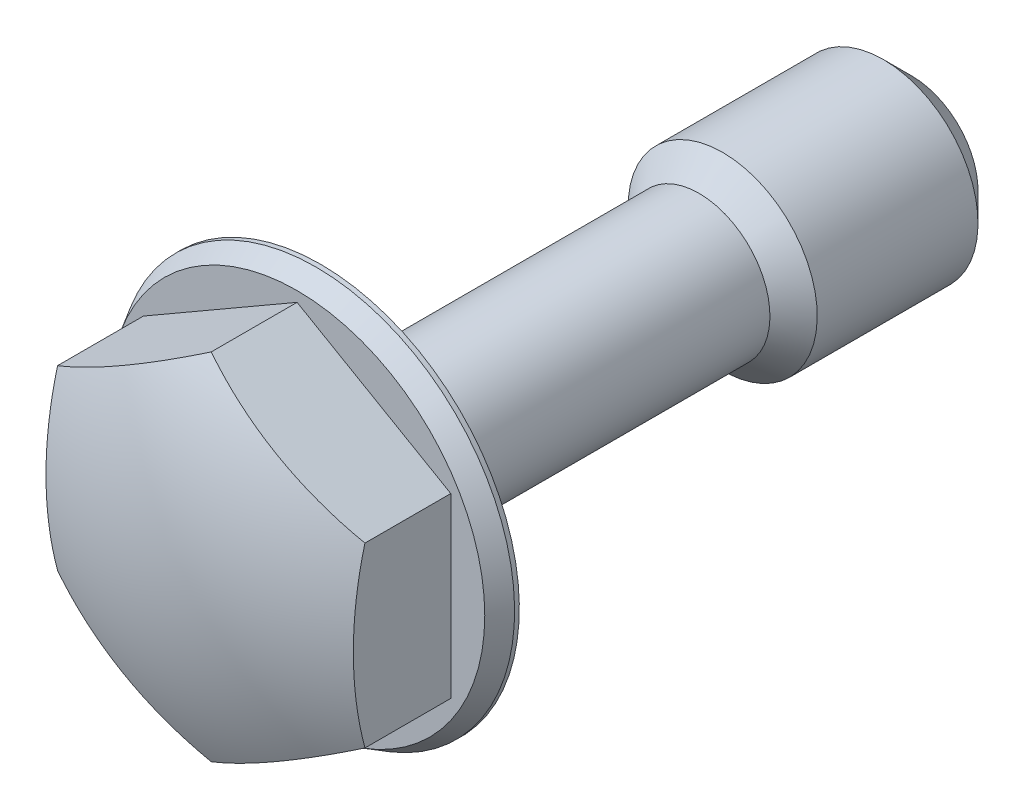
ISO-10303-21;
HEADER;
FILE_DESCRIPTION(('STEP AP214'),'2;1');
FILE_NAME('part.step','',(''),(''),'','','');
FILE_SCHEMA(('AUTOMOTIVE_DESIGN { 1 0 10303 214 1 1 1 1 }'));
ENDSEC;
DATA;
#1=APPLICATION_CONTEXT('core data for automotive mechanical design processes');
#2=APPLICATION_PROTOCOL_DEFINITION('international standard','automotive_design',2000,#1);
#3=PRODUCT_CONTEXT('',#1,'mechanical');
#4=PRODUCT('Part','Part','',(#3));
#5=PRODUCT_RELATED_PRODUCT_CATEGORY('part','',(#4));
#6=PRODUCT_DEFINITION_FORMATION('','',#4);
#7=PRODUCT_DEFINITION_CONTEXT('part definition',#1,'design');
#8=PRODUCT_DEFINITION('design','',#6,#7);
#9=PRODUCT_DEFINITION_SHAPE('','',#8);
#10=(LENGTH_UNIT() NAMED_UNIT(*) SI_UNIT(.MILLI.,.METRE.));
#11=(NAMED_UNIT(*) PLANE_ANGLE_UNIT() SI_UNIT($,.RADIAN.));
#12=(NAMED_UNIT(*) SI_UNIT($,.STERADIAN.) SOLID_ANGLE_UNIT());
#13=UNCERTAINTY_MEASURE_WITH_UNIT(LENGTH_MEASURE(1.E-05),#10,'distance_accuracy_value','');
#14=(GEOMETRIC_REPRESENTATION_CONTEXT(3) GLOBAL_UNCERTAINTY_ASSIGNED_CONTEXT((#13)) GLOBAL_UNIT_ASSIGNED_CONTEXT((#10,
#11,#12)) REPRESENTATION_CONTEXT('',''));
#15=CARTESIAN_POINT('',(0.,0.,0.));
#16=DIRECTION('',(0.,0.,1.));
#17=DIRECTION('',(1.,0.,0.));
#18=AXIS2_PLACEMENT_3D('',#15,#16,#17);
#19=CARTESIAN_POINT('',(0.,0.,1.));
#20=DIRECTION('',(0.,0.,-1.));
#21=DIRECTION('',(0.,1.,0.));
#22=AXIS2_PLACEMENT_3D('',#19,#20,#21);
#23=CONICAL_SURFACE('',#22,7.9381197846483,0.523598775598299);
#24=CARTESIAN_POINT('',(0.,0.,0.2));
#25=DIRECTION('',(0.,0.,-1.));
#26=DIRECTION('',(0.,1.,0.));
#27=AXIS2_PLACEMENT_3D('',#24,#25,#26);
#28=CIRCLE('',#27,8.4);
#29=CARTESIAN_POINT('',(0.,8.4,0.2));
#30=VERTEX_POINT('',#29);
#31=EDGE_CURVE('E117',#30,#30,#28,.T.);
#32=ORIENTED_EDGE('',*,*,#31,.F.);
#33=EDGE_LOOP('',(#32));
#34=FACE_BOUND('',#33,.T.);
#35=CARTESIAN_POINT('',(0.,0.,1.));
#36=DIRECTION('',(0.,0.,1.));
#37=DIRECTION('',(0.,-1.,0.));
#38=AXIS2_PLACEMENT_3D('',#35,#36,#37);
#39=CIRCLE('',#38,7.9381197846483);
#40=CARTESIAN_POINT('',(0.,-7.9381197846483,1.));
#41=VERTEX_POINT('',#40);
#42=EDGE_CURVE('E95',#41,#41,#39,.T.);
#43=ORIENTED_EDGE('',*,*,#42,.F.);
#44=EDGE_LOOP('',(#43));
#45=FACE_BOUND('',#44,.T.);
#46=ADVANCED_FACE('F14',(#34,#45),#23,.T.);
#47=CARTESIAN_POINT('',(0.,0.,-20.));
#48=DIRECTION('',(0.,0.,-1.));
#49=DIRECTION('',(0.,1.,0.));
#50=AXIS2_PLACEMENT_3D('',#47,#48,#49);
#51=CYLINDRICAL_SURFACE('',#50,8.4);
#52=CARTESIAN_POINT('',(0.,0.,0.));
#53=DIRECTION('',(0.,0.,-1.));
#54=DIRECTION('',(0.,1.,0.));
#55=AXIS2_PLACEMENT_3D('',#52,#53,#54);
#56=CIRCLE('',#55,8.4);
#57=CARTESIAN_POINT('',(0.,8.4,0.));
#58=VERTEX_POINT('',#57);
#59=EDGE_CURVE('E114',#58,#58,#56,.T.);
#60=ORIENTED_EDGE('',*,*,#59,.F.);
#61=EDGE_LOOP('',(#60));
#62=FACE_BOUND('',#61,.T.);
#63=ORIENTED_EDGE('',*,*,#31,.T.);
#64=EDGE_LOOP('',(#63));
#65=FACE_BOUND('',#64,.T.);
#66=ADVANCED_FACE('F156',(#62,#65),#51,.T.);
#67=CARTESIAN_POINT('',(8.4,0.,0.));
#68=DIRECTION('',(0.,0.,1.));
#69=DIRECTION('',(0.,-1.,0.));
#70=AXIS2_PLACEMENT_3D('',#67,#68,#69);
#71=PLANE('',#70);
#72=CARTESIAN_POINT('',(0.,0.,0.));
#73=DIRECTION('',(0.,0.,-1.));
#74=DIRECTION('',(0.,1.,0.));
#75=AXIS2_PLACEMENT_3D('',#72,#73,#74);
#76=CIRCLE('',#75,3.6);
#77=CARTESIAN_POINT('',(0.,3.6,0.));
#78=VERTEX_POINT('',#77);
#79=EDGE_CURVE('E111',#78,#78,#76,.T.);
#80=ORIENTED_EDGE('',*,*,#79,.F.);
#81=EDGE_LOOP('',(#80));
#82=FACE_BOUND('',#81,.T.);
#83=ORIENTED_EDGE('',*,*,#59,.T.);
#84=EDGE_LOOP('',(#83));
#85=FACE_BOUND('',#84,.T.);
#86=ADVANCED_FACE('F162',(#82,#85),#71,.F.);
#87=CARTESIAN_POINT('',(0.,0.,-0.6));
#88=DIRECTION('',(0.,0.,-1.));
#89=DIRECTION('',(0.,1.,0.));
#90=AXIS2_PLACEMENT_3D('',#87,#88,#89);
#91=TOROIDAL_SURFACE('',#90,3.6,0.6);
#92=CARTESIAN_POINT('',(0.,0.,-0.6));
#93=DIRECTION('',(0.,0.,-1.));
#94=DIRECTION('',(0.,1.,0.));
#95=AXIS2_PLACEMENT_3D('',#92,#93,#94);
#96=CIRCLE('',#95,3.);
#97=CARTESIAN_POINT('',(0.,3.,-0.6));
#98=VERTEX_POINT('',#97);
#99=EDGE_CURVE('E108',#98,#98,#96,.T.);
#100=ORIENTED_EDGE('',*,*,#99,.F.);
#101=EDGE_LOOP('',(#100));
#102=FACE_BOUND('',#101,.T.);
#103=ORIENTED_EDGE('',*,*,#79,.T.);
#104=EDGE_LOOP('',(#103));
#105=FACE_BOUND('',#104,.T.);
#106=ADVANCED_FACE('F195',(#102,#105),#91,.F.);
#107=CARTESIAN_POINT('',(0.,0.,-20.));
#108=DIRECTION('',(0.,0.,-1.));
#109=DIRECTION('',(0.,1.,0.));
#110=AXIS2_PLACEMENT_3D('',#107,#108,#109);
#111=CYLINDRICAL_SURFACE('',#110,3.);
#112=ORIENTED_EDGE('',*,*,#99,.T.);
#113=EDGE_LOOP('',(#112));
#114=FACE_BOUND('',#113,.T.);
#115=CARTESIAN_POINT('',(0.,0.,-16.));
#116=DIRECTION('',(0.,0.,-1.));
#117=DIRECTION('',(0.,1.,0.));
#118=AXIS2_PLACEMENT_3D('',#115,#116,#117);
#119=CIRCLE('',#118,3.);
#120=CARTESIAN_POINT('',(0.,3.,-16.));
#121=VERTEX_POINT('',#120);
#122=EDGE_CURVE('E83',#121,#121,#119,.T.);
#123=ORIENTED_EDGE('',*,*,#122,.F.);
#124=EDGE_LOOP('',(#123));
#125=FACE_BOUND('',#124,.T.);
#126=ADVANCED_FACE('F193',(#114,#125),#111,.T.);
#127=CARTESIAN_POINT('',(0.,0.,1.));
#128=DIRECTION('',(0.,0.,1.));
#129=DIRECTION('',(0.,-1.,0.));
#130=AXIS2_PLACEMENT_3D('',#127,#128,#129);
#131=PLANE('',#130);
#132=DIRECTION('',(0.,-1.,0.));
#133=VECTOR('',#132,1.);
#134=CARTESIAN_POINT('',(-6.5,3.75277674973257,1.));
#135=LINE('',#134,#133);
#136=CARTESIAN_POINT('',(-6.5,3.75277674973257,1.));
#137=VERTEX_POINT('',#136);
#138=CARTESIAN_POINT('',(-6.5,-3.75277674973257,1.));
#139=VERTEX_POINT('',#138);
#140=EDGE_CURVE('E72',#137,#139,#135,.T.);
#141=ORIENTED_EDGE('',*,*,#140,.F.);
#142=DIRECTION('',(-0.866025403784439,-0.5,0.));
#143=VECTOR('',#142,1.);
#144=CARTESIAN_POINT('',(0.,7.50555349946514,1.));
#145=LINE('',#144,#143);
#146=CARTESIAN_POINT('',(0.,7.50555349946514,1.));
#147=VERTEX_POINT('',#146);
#148=EDGE_CURVE('E88',#147,#137,#145,.T.);
#149=ORIENTED_EDGE('',*,*,#148,.F.);
#150=DIRECTION('',(-0.866025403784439,0.5,0.));
#151=VECTOR('',#150,1.);
#152=CARTESIAN_POINT('',(6.5,3.75277674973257,1.));
#153=LINE('',#152,#151);
#154=CARTESIAN_POINT('',(6.5,3.75277674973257,1.));
#155=VERTEX_POINT('',#154);
#156=EDGE_CURVE('E90',#155,#147,#153,.T.);
#157=ORIENTED_EDGE('',*,*,#156,.F.);
#158=DIRECTION('',(0.,1.,0.));
#159=VECTOR('',#158,1.);
#160=CARTESIAN_POINT('',(6.5,-3.75277674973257,1.));
#161=LINE('',#160,#159);
#162=CARTESIAN_POINT('',(6.5,-3.75277674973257,1.));
#163=VERTEX_POINT('',#162);
#164=EDGE_CURVE('E184',#163,#155,#161,.T.);
#165=ORIENTED_EDGE('',*,*,#164,.F.);
#166=DIRECTION('',(0.866025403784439,0.5,0.));
#167=VECTOR('',#166,1.);
#168=CARTESIAN_POINT('',(0.,-7.50555349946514,1.));
#169=LINE('',#168,#167);
#170=CARTESIAN_POINT('',(0.,-7.50555349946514,1.));
#171=VERTEX_POINT('',#170);
#172=EDGE_CURVE('E82',#171,#163,#169,.T.);
#173=ORIENTED_EDGE('',*,*,#172,.F.);
#174=DIRECTION('',(0.866025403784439,-0.5,0.));
#175=VECTOR('',#174,1.);
#176=CARTESIAN_POINT('',(-6.5,-3.75277674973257,1.));
#177=LINE('',#176,#175);
#178=EDGE_CURVE('E68',#139,#171,#177,.T.);
#179=ORIENTED_EDGE('',*,*,#178,.F.);
#180=EDGE_LOOP('',(#141,#149,#157,#165,#173,#179));
#181=FACE_BOUND('',#180,.T.);
#182=ORIENTED_EDGE('',*,*,#42,.T.);
#183=EDGE_LOOP('',(#182));
#184=FACE_BOUND('',#183,.T.);
#185=ADVANCED_FACE('F77',(#181,#184),#131,.T.);
#186=CARTESIAN_POINT('',(-6.5,3.75277674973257,1.));
#187=DIRECTION('',(-1.,0.,0.));
#188=DIRECTION('',(0.,-1.,0.));
#189=AXIS2_PLACEMENT_3D('',#186,#187,#188);
#190=PLANE('',#189);
#191=DIRECTION('',(0.,0.,1.));
#192=VECTOR('',#191,1.);
#193=CARTESIAN_POINT('',(-6.5,3.75277674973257,1.));
#194=LINE('',#193,#192);
#195=CARTESIAN_POINT('',(-6.5,3.75277674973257,4.6303455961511));
#196=VERTEX_POINT('',#195);
#197=EDGE_CURVE('E86',#137,#196,#194,.T.);
#198=ORIENTED_EDGE('',*,*,#197,.F.);
#199=ORIENTED_EDGE('',*,*,#140,.T.);
#200=DIRECTION('',(0.,0.,1.));
#201=VECTOR('',#200,1.);
#202=CARTESIAN_POINT('',(-6.5,-3.75277674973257,1.));
#203=LINE('',#202,#201);
#204=CARTESIAN_POINT('',(-6.5,-3.75277674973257,4.6303455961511));
#205=VERTEX_POINT('',#204);
#206=EDGE_CURVE('E65',#139,#205,#203,.T.);
#207=ORIENTED_EDGE('',*,*,#206,.T.);
#208=CARTESIAN_POINT('',(-6.5,0.,-9.5));
#209=DIRECTION('',(-1.,0.,0.));
#210=DIRECTION('',(0.,-1.,0.));
#211=AXIS2_PLACEMENT_3D('',#208,#209,#210);
#212=CIRCLE('',#211,14.6201915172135);
#213=EDGE_CURVE('E37',#196,#205,#212,.F.);
#214=ORIENTED_EDGE('',*,*,#213,.F.);
#215=EDGE_LOOP('',(#198,#199,#207,#214));
#216=FACE_BOUND('',#215,.T.);
#217=ADVANCED_FACE('F85',(#216),#190,.T.);
#218=CARTESIAN_POINT('',(0.,7.50555349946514,1.));
#219=DIRECTION('',(-0.5,0.866025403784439,0.));
#220=DIRECTION('',(-0.866025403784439,-0.5,0.));
#221=AXIS2_PLACEMENT_3D('',#218,#219,#220);
#222=PLANE('',#221);
#223=DIRECTION('',(0.,0.,1.));
#224=VECTOR('',#223,1.);
#225=CARTESIAN_POINT('',(0.,7.50555349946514,1.));
#226=LINE('',#225,#224);
#227=CARTESIAN_POINT('',(0.,7.50555349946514,4.6303455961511));
#228=VERTEX_POINT('',#227);
#229=EDGE_CURVE('E96',#147,#228,#226,.T.);
#230=ORIENTED_EDGE('',*,*,#229,.F.);
#231=ORIENTED_EDGE('',*,*,#148,.T.);
#232=ORIENTED_EDGE('',*,*,#197,.T.);
#233=CARTESIAN_POINT('',(-3.25,5.62916512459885,-9.5));
#234=DIRECTION('',(-0.5,0.866025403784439,0.));
#235=DIRECTION('',(-0.866025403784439,-0.5,0.));
#236=AXIS2_PLACEMENT_3D('',#233,#234,#235);
#237=CIRCLE('',#236,14.6201915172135);
#238=EDGE_CURVE('E130',#228,#196,#237,.F.);
#239=ORIENTED_EDGE('',*,*,#238,.F.);
#240=EDGE_LOOP('',(#230,#231,#232,#239));
#241=FACE_BOUND('',#240,.T.);
#242=ADVANCED_FACE('F245',(#241),#222,.T.);
#243=CARTESIAN_POINT('',(6.5,3.75277674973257,1.));
#244=DIRECTION('',(0.5,0.866025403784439,0.));
#245=DIRECTION('',(-0.866025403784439,0.5,0.));
#246=AXIS2_PLACEMENT_3D('',#243,#244,#245);
#247=PLANE('',#246);
#248=DIRECTION('',(0.,0.,1.));
#249=VECTOR('',#248,1.);
#250=CARTESIAN_POINT('',(6.5,3.75277674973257,1.));
#251=LINE('',#250,#249);
#252=CARTESIAN_POINT('',(6.5,3.75277674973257,4.6303455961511));
#253=VERTEX_POINT('',#252);
#254=EDGE_CURVE('E99',#155,#253,#251,.T.);
#255=ORIENTED_EDGE('',*,*,#254,.F.);
#256=ORIENTED_EDGE('',*,*,#156,.T.);
#257=ORIENTED_EDGE('',*,*,#229,.T.);
#258=CARTESIAN_POINT('',(3.25,5.62916512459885,-9.5));
#259=DIRECTION('',(0.5,0.866025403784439,0.));
#260=DIRECTION('',(-0.866025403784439,0.5,0.));
#261=AXIS2_PLACEMENT_3D('',#258,#259,#260);
#262=CIRCLE('',#261,14.6201915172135);
#263=EDGE_CURVE('E127',#253,#228,#262,.F.);
#264=ORIENTED_EDGE('',*,*,#263,.F.);
#265=EDGE_LOOP('',(#255,#256,#257,#264));
#266=FACE_BOUND('',#265,.T.);
#267=ADVANCED_FACE('F178',(#266),#247,.T.);
#268=CARTESIAN_POINT('',(6.5,-3.75277674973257,1.));
#269=DIRECTION('',(1.,0.,0.));
#270=DIRECTION('',(0.,1.,0.));
#271=AXIS2_PLACEMENT_3D('',#268,#269,#270);
#272=PLANE('',#271);
#273=DIRECTION('',(0.,0.,1.));
#274=VECTOR('',#273,1.);
#275=CARTESIAN_POINT('',(6.5,-3.75277674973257,1.));
#276=LINE('',#275,#274);
#277=CARTESIAN_POINT('',(6.5,-3.75277674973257,4.6303455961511));
#278=VERTEX_POINT('',#277);
#279=EDGE_CURVE('E102',#163,#278,#276,.T.);
#280=ORIENTED_EDGE('',*,*,#279,.F.);
#281=ORIENTED_EDGE('',*,*,#164,.T.);
#282=ORIENTED_EDGE('',*,*,#254,.T.);
#283=CARTESIAN_POINT('',(6.5,0.,-9.5));
#284=DIRECTION('',(1.,0.,0.));
#285=DIRECTION('',(0.,1.,0.));
#286=AXIS2_PLACEMENT_3D('',#283,#284,#285);
#287=CIRCLE('',#286,14.6201915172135);
#288=EDGE_CURVE('E124',#278,#253,#287,.F.);
#289=ORIENTED_EDGE('',*,*,#288,.F.);
#290=EDGE_LOOP('',(#280,#281,#282,#289));
#291=FACE_BOUND('',#290,.T.);
#292=ADVANCED_FACE('F183',(#291),#272,.T.);
#293=CARTESIAN_POINT('',(0.,-7.50555349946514,1.));
#294=DIRECTION('',(0.5,-0.866025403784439,0.));
#295=DIRECTION('',(0.866025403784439,0.5,0.));
#296=AXIS2_PLACEMENT_3D('',#293,#294,#295);
#297=PLANE('',#296);
#298=DIRECTION('',(0.,0.,1.));
#299=VECTOR('',#298,1.);
#300=CARTESIAN_POINT('',(0.,-7.50555349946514,1.));
#301=LINE('',#300,#299);
#302=CARTESIAN_POINT('',(0.,-7.50555349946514,4.6303455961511));
#303=VERTEX_POINT('',#302);
#304=EDGE_CURVE('E29',#171,#303,#301,.T.);
#305=ORIENTED_EDGE('',*,*,#304,.F.);
#306=ORIENTED_EDGE('',*,*,#172,.T.);
#307=ORIENTED_EDGE('',*,*,#279,.T.);
#308=CARTESIAN_POINT('',(3.25,-5.62916512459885,-9.5));
#309=DIRECTION('',(0.5,-0.866025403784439,0.));
#310=DIRECTION('',(0.866025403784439,0.5,0.));
#311=AXIS2_PLACEMENT_3D('',#308,#309,#310);
#312=CIRCLE('',#311,14.6201915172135);
#313=EDGE_CURVE('E121',#303,#278,#312,.F.);
#314=ORIENTED_EDGE('',*,*,#313,.F.);
#315=EDGE_LOOP('',(#305,#306,#307,#314));
#316=FACE_BOUND('',#315,.T.);
#317=ADVANCED_FACE('F174',(#316),#297,.T.);
#318=CARTESIAN_POINT('',(-6.5,-3.75277674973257,1.));
#319=DIRECTION('',(-0.5,-0.866025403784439,0.));
#320=DIRECTION('',(0.866025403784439,-0.5,0.));
#321=AXIS2_PLACEMENT_3D('',#318,#319,#320);
#322=PLANE('',#321);
#323=ORIENTED_EDGE('',*,*,#206,.F.);
#324=ORIENTED_EDGE('',*,*,#178,.T.);
#325=ORIENTED_EDGE('',*,*,#304,.T.);
#326=CARTESIAN_POINT('',(-3.25,-5.62916512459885,-9.5));
#327=DIRECTION('',(-0.5,-0.866025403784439,0.));
#328=DIRECTION('',(0.866025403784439,-0.5,0.));
#329=AXIS2_PLACEMENT_3D('',#326,#327,#328);
#330=CIRCLE('',#329,14.6201915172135);
#331=EDGE_CURVE('E70',#205,#303,#330,.F.);
#332=ORIENTED_EDGE('',*,*,#331,.F.);
#333=EDGE_LOOP('',(#323,#324,#325,#332));
#334=FACE_BOUND('',#333,.T.);
#335=ADVANCED_FACE('F67',(#334),#322,.T.);
#336=CARTESIAN_POINT('',(0.,0.,-9.5));
#337=DIRECTION('',(0.,0.,-1.));
#338=DIRECTION('',(1.,0.,0.));
#339=AXIS2_PLACEMENT_3D('',#336,#337,#338);
#340=SPHERICAL_SURFACE('',#339,16.);
#341=ORIENTED_EDGE('',*,*,#263,.T.);
#342=ORIENTED_EDGE('',*,*,#238,.T.);
#343=ORIENTED_EDGE('',*,*,#213,.T.);
#344=ORIENTED_EDGE('',*,*,#331,.T.);
#345=ORIENTED_EDGE('',*,*,#313,.T.);
#346=ORIENTED_EDGE('',*,*,#288,.T.);
#347=EDGE_LOOP('',(#341,#342,#343,#344,#345,#346));
#348=FACE_BOUND('',#347,.T.);
#349=ADVANCED_FACE('F152',(#348),#340,.T.);
#350=CARTESIAN_POINT('',(0.,0.,-25.));
#351=DIRECTION('',(0.,0.,1.));
#352=DIRECTION('',(0.,-1.,0.));
#353=AXIS2_PLACEMENT_3D('',#350,#351,#352);
#354=CYLINDRICAL_SURFACE('',#353,4.);
#355=CARTESIAN_POINT('',(0.,0.,-17.));
#356=DIRECTION('',(0.,0.,-1.));
#357=DIRECTION('',(0.,1.,0.));
#358=AXIS2_PLACEMENT_3D('',#355,#356,#357);
#359=CIRCLE('',#358,4.);
#360=CARTESIAN_POINT('',(0.,4.,-17.));
#361=VERTEX_POINT('',#360);
#362=EDGE_CURVE('E9',#361,#361,#359,.T.);
#363=ORIENTED_EDGE('',*,*,#362,.T.);
#364=EDGE_LOOP('',(#363));
#365=FACE_BOUND('',#364,.T.);
#366=CARTESIAN_POINT('',(0.,0.,-23.8));
#367=DIRECTION('',(0.,0.,-1.));
#368=DIRECTION('',(0.,1.,0.));
#369=AXIS2_PLACEMENT_3D('',#366,#367,#368);
#370=CIRCLE('',#369,4.);
#371=CARTESIAN_POINT('',(0.,4.,-23.8));
#372=VERTEX_POINT('',#371);
#373=EDGE_CURVE('E22',#372,#372,#370,.F.);
#374=ORIENTED_EDGE('',*,*,#373,.T.);
#375=EDGE_LOOP('',(#374));
#376=FACE_BOUND('',#375,.T.);
#377=ADVANCED_FACE('F138',(#365,#376),#354,.T.);
#378=CARTESIAN_POINT('',(0.,0.,-25.));
#379=DIRECTION('',(0.,0.,-1.));
#380=DIRECTION('',(0.,1.,0.));
#381=AXIS2_PLACEMENT_3D('',#378,#379,#380);
#382=PLANE('',#381);
#383=CARTESIAN_POINT('',(0.,0.,-25.));
#384=DIRECTION('',(0.,0.,-1.));
#385=DIRECTION('',(0.,1.,0.));
#386=AXIS2_PLACEMENT_3D('',#383,#384,#385);
#387=CIRCLE('',#386,2.8);
#388=CARTESIAN_POINT('',(0.,2.8,-25.));
#389=VERTEX_POINT('',#388);
#390=EDGE_CURVE('E133',#389,#389,#387,.T.);
#391=ORIENTED_EDGE('',*,*,#390,.T.);
#392=EDGE_LOOP('',(#391));
#393=FACE_BOUND('',#392,.T.);
#394=ADVANCED_FACE('F143',(#393),#382,.T.);
#395=CARTESIAN_POINT('',(0.,0.,-25.));
#396=DIRECTION('',(0.,0.,1.));
#397=DIRECTION('',(0.,-1.,0.));
#398=AXIS2_PLACEMENT_3D('',#395,#396,#397);
#399=CONICAL_SURFACE('',#398,2.8,0.785398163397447);
#400=ORIENTED_EDGE('',*,*,#373,.F.);
#401=EDGE_LOOP('',(#400));
#402=FACE_BOUND('',#401,.T.);
#403=ORIENTED_EDGE('',*,*,#390,.F.);
#404=EDGE_LOOP('',(#403));
#405=FACE_BOUND('',#404,.T.);
#406=ADVANCED_FACE('F140',(#402,#405),#399,.T.);
#407=CARTESIAN_POINT('',(0.,0.,-17.));
#408=DIRECTION('',(0.,0.,-1.));
#409=DIRECTION('',(0.,1.,0.));
#410=AXIS2_PLACEMENT_3D('',#407,#408,#409);
#411=CONICAL_SURFACE('',#410,4.,0.785398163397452);
#412=ORIENTED_EDGE('',*,*,#122,.T.);
#413=EDGE_LOOP('',(#412));
#414=FACE_BOUND('',#413,.T.);
#415=ORIENTED_EDGE('',*,*,#362,.F.);
#416=EDGE_LOOP('',(#415));
#417=FACE_BOUND('',#416,.T.);
#418=ADVANCED_FACE('F16',(#414,#417),#411,.T.);
#419=CLOSED_SHELL('',(#46,#66,#86,#106,#126,#185,#217,#242,#267,#292,#317,#335,#349,#377,#394,
#406,#418));
#420=MANIFOLD_SOLID_BREP('B1',#419);
#421=ADVANCED_BREP_SHAPE_REPRESENTATION('',(#18,#420),#14);
#422=SHAPE_DEFINITION_REPRESENTATION(#9,#421);
ENDSEC;
END-ISO-10303-21;
